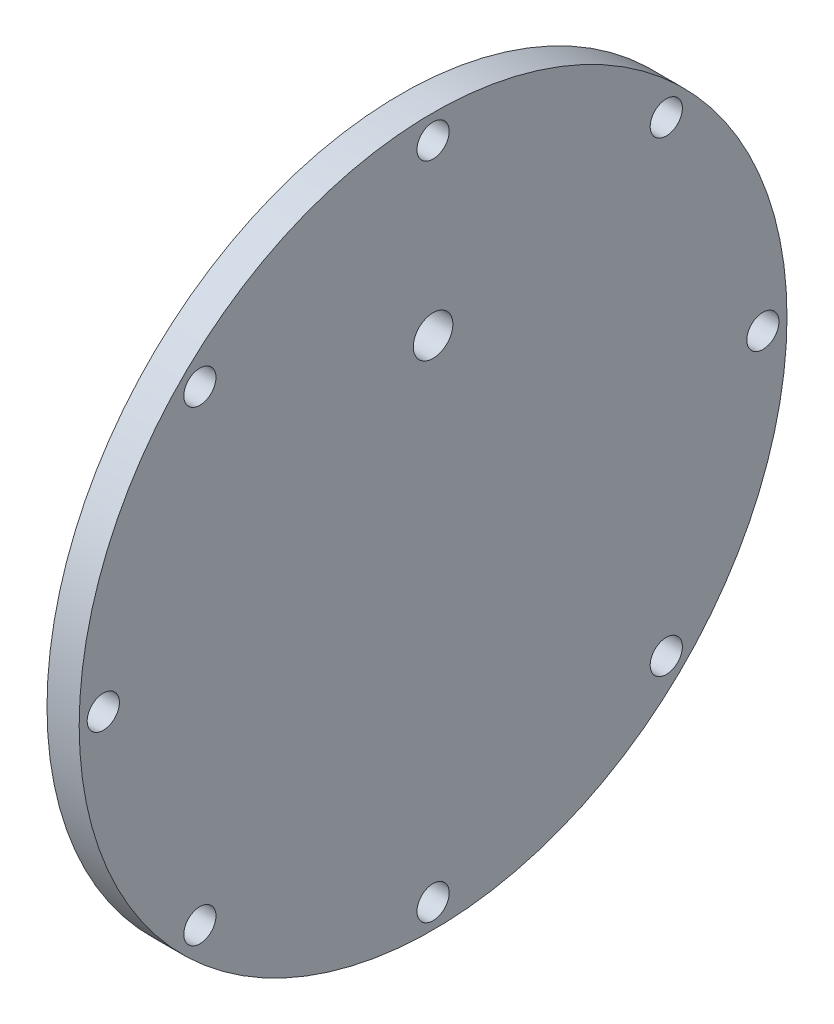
ISO-10303-21;
HEADER;
FILE_DESCRIPTION(('STEP AP214'),'2;1');
FILE_NAME('part.step','',(''),(''),'','','');
FILE_SCHEMA(('AUTOMOTIVE_DESIGN { 1 0 10303 214 1 1 1 1 }'));
ENDSEC;
DATA;
#1=APPLICATION_CONTEXT('core data for automotive mechanical design processes');
#2=APPLICATION_PROTOCOL_DEFINITION('international standard','automotive_design',2000,#1);
#3=PRODUCT_CONTEXT('',#1,'mechanical');
#4=PRODUCT('Part','Part','',(#3));
#5=PRODUCT_RELATED_PRODUCT_CATEGORY('part','',(#4));
#6=PRODUCT_DEFINITION_FORMATION('','',#4);
#7=PRODUCT_DEFINITION_CONTEXT('part definition',#1,'design');
#8=PRODUCT_DEFINITION('design','',#6,#7);
#9=PRODUCT_DEFINITION_SHAPE('','',#8);
#10=(LENGTH_UNIT() NAMED_UNIT(*) SI_UNIT(.MILLI.,.METRE.));
#11=(NAMED_UNIT(*) PLANE_ANGLE_UNIT() SI_UNIT($,.RADIAN.));
#12=(NAMED_UNIT(*) SI_UNIT($,.STERADIAN.) SOLID_ANGLE_UNIT());
#13=UNCERTAINTY_MEASURE_WITH_UNIT(LENGTH_MEASURE(1.E-05),#10,'distance_accuracy_value','');
#14=(GEOMETRIC_REPRESENTATION_CONTEXT(3) GLOBAL_UNCERTAINTY_ASSIGNED_CONTEXT((#13)) GLOBAL_UNIT_ASSIGNED_CONTEXT((#10,
#11,#12)) REPRESENTATION_CONTEXT('',''));
#15=CARTESIAN_POINT('',(0.,0.,0.));
#16=DIRECTION('',(0.,0.,1.));
#17=DIRECTION('',(1.,0.,0.));
#18=AXIS2_PLACEMENT_3D('',#15,#16,#17);
#19=CARTESIAN_POINT('',(6.35,0.,0.));
#20=DIRECTION('',(1.,0.,0.));
#21=DIRECTION('',(0.,0.,-1.));
#22=AXIS2_PLACEMENT_3D('',#19,#20,#21);
#23=PLANE('',#22);
#24=CARTESIAN_POINT('',(6.35,31.75,0.));
#25=DIRECTION('',(1.,0.,0.));
#26=DIRECTION('',(0.,0.,-1.));
#27=AXIS2_PLACEMENT_3D('',#24,#25,#26);
#28=CIRCLE('',#27,3.90271);
#29=CARTESIAN_POINT('',(6.35,31.75,-3.90271));
#30=VERTEX_POINT('',#29);
#31=EDGE_CURVE('E98',#30,#30,#28,.T.);
#32=ORIENTED_EDGE('',*,*,#31,.F.);
#33=EDGE_LOOP('',(#32));
#34=FACE_BOUND('',#33,.T.);
#35=CARTESIAN_POINT('',(6.35,6.81755374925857E-13,65.0875));
#36=DIRECTION('',(1.,0.,0.));
#37=DIRECTION('',(0.,0.,-1.));
#38=AXIS2_PLACEMENT_3D('',#35,#36,#37);
#39=CIRCLE('',#38,3.175);
#40=CARTESIAN_POINT('',(6.35,6.81755374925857E-13,61.9125));
#41=VERTEX_POINT('',#40);
#42=EDGE_CURVE('E85',#41,#41,#39,.T.);
#43=ORIENTED_EDGE('',*,*,#42,.F.);
#44=EDGE_LOOP('',(#43));
#45=FACE_BOUND('',#44,.T.);
#46=CARTESIAN_POINT('',(6.35,-65.0875,4.54503583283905E-13));
#47=DIRECTION('',(1.,0.,0.));
#48=DIRECTION('',(0.,0.,-1.));
#49=AXIS2_PLACEMENT_3D('',#46,#47,#48);
#50=CIRCLE('',#49,3.175);
#51=CARTESIAN_POINT('',(6.35,-65.0875,-3.17499999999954));
#52=VERTEX_POINT('',#51);
#53=EDGE_CURVE('E72',#52,#52,#50,.T.);
#54=ORIENTED_EDGE('',*,*,#53,.F.);
#55=EDGE_LOOP('',(#54));
#56=FACE_BOUND('',#55,.T.);
#57=CARTESIAN_POINT('',(6.35,-2.27251791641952E-13,-65.0875));
#58=DIRECTION('',(1.,0.,0.));
#59=DIRECTION('',(0.,0.,-1.));
#60=AXIS2_PLACEMENT_3D('',#57,#58,#59);
#61=CIRCLE('',#60,3.175);
#62=CARTESIAN_POINT('',(6.35,-2.27251791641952E-13,-68.2625));
#63=VERTEX_POINT('',#62);
#64=EDGE_CURVE('E56',#63,#63,#61,.T.);
#65=ORIENTED_EDGE('',*,*,#64,.F.);
#66=EDGE_LOOP('',(#65));
#67=FACE_BOUND('',#66,.T.);
#68=CARTESIAN_POINT('',(6.35,65.0875,0.));
#69=DIRECTION('',(1.,0.,0.));
#70=DIRECTION('',(0.,0.,-1.));
#71=AXIS2_PLACEMENT_3D('',#68,#69,#70);
#72=CIRCLE('',#71,3.175);
#73=CARTESIAN_POINT('',(6.35,65.0875,-3.175));
#74=VERTEX_POINT('',#73);
#75=EDGE_CURVE('E48',#74,#74,#72,.T.);
#76=ORIENTED_EDGE('',*,*,#75,.F.);
#77=EDGE_LOOP('',(#76));
#78=FACE_BOUND('',#77,.T.);
#79=CARTESIAN_POINT('',(6.35,0.,0.));
#80=DIRECTION('',(1.,0.,0.));
#81=DIRECTION('',(0.,0.,-1.));
#82=AXIS2_PLACEMENT_3D('',#79,#80,#81);
#83=CIRCLE('',#82,69.85);
#84=CARTESIAN_POINT('',(6.35,0.,-69.85));
#85=VERTEX_POINT('',#84);
#86=EDGE_CURVE('E10',#85,#85,#83,.T.);
#87=ORIENTED_EDGE('',*,*,#86,.T.);
#88=EDGE_LOOP('',(#87));
#89=FACE_BOUND('',#88,.T.);
#90=CARTESIAN_POINT('',(6.35,46.0238126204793,-46.0238126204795));
#91=DIRECTION('',(1.,0.,0.));
#92=DIRECTION('',(0.,0.,-1.));
#93=AXIS2_PLACEMENT_3D('',#90,#91,#92);
#94=CIRCLE('',#93,3.175);
#95=CARTESIAN_POINT('',(6.35,46.0238126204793,-49.1988126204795));
#96=VERTEX_POINT('',#95);
#97=EDGE_CURVE('E52',#96,#96,#94,.T.);
#98=ORIENTED_EDGE('',*,*,#97,.F.);
#99=EDGE_LOOP('',(#98));
#100=FACE_BOUND('',#99,.T.);
#101=CARTESIAN_POINT('',(6.35,-46.0238126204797,-46.0238126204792));
#102=DIRECTION('',(1.,0.,0.));
#103=DIRECTION('',(0.,0.,-1.));
#104=AXIS2_PLACEMENT_3D('',#101,#102,#103);
#105=CIRCLE('',#104,3.175);
#106=CARTESIAN_POINT('',(6.35,-46.0238126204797,-49.1988126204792));
#107=VERTEX_POINT('',#106);
#108=EDGE_CURVE('E62',#107,#107,#105,.T.);
#109=ORIENTED_EDGE('',*,*,#108,.F.);
#110=EDGE_LOOP('',(#109));
#111=FACE_BOUND('',#110,.T.);
#112=CARTESIAN_POINT('',(6.35,-46.023812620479,46.0238126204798));
#113=DIRECTION('',(1.,0.,0.));
#114=DIRECTION('',(0.,0.,-1.));
#115=AXIS2_PLACEMENT_3D('',#112,#113,#114);
#116=CIRCLE('',#115,3.175);
#117=CARTESIAN_POINT('',(6.35,-46.023812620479,42.8488126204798));
#118=VERTEX_POINT('',#117);
#119=EDGE_CURVE('E76',#118,#118,#116,.T.);
#120=ORIENTED_EDGE('',*,*,#119,.F.);
#121=EDGE_LOOP('',(#120));
#122=FACE_BOUND('',#121,.T.);
#123=CARTESIAN_POINT('',(6.35,46.02381262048,46.0238126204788));
#124=DIRECTION('',(1.,0.,0.));
#125=DIRECTION('',(0.,0.,-1.));
#126=AXIS2_PLACEMENT_3D('',#123,#124,#125);
#127=CIRCLE('',#126,3.175);
#128=CARTESIAN_POINT('',(6.35,46.02381262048,42.8488126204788));
#129=VERTEX_POINT('',#128);
#130=EDGE_CURVE('E90',#129,#129,#127,.T.);
#131=ORIENTED_EDGE('',*,*,#130,.F.);
#132=EDGE_LOOP('',(#131));
#133=FACE_BOUND('',#132,.T.);
#134=ADVANCED_FACE('F40',(#34,#45,#56,#67,#78,#89,#100,#111,#122,#133),#23,.T.);
#135=CARTESIAN_POINT('',(0.,0.,0.));
#136=DIRECTION('',(1.,0.,0.));
#137=DIRECTION('',(0.,0.,-1.));
#138=AXIS2_PLACEMENT_3D('',#135,#136,#137);
#139=PLANE('',#138);
#140=CARTESIAN_POINT('',(0.,31.75,0.));
#141=DIRECTION('',(1.,0.,0.));
#142=DIRECTION('',(0.,0.,-1.));
#143=AXIS2_PLACEMENT_3D('',#140,#141,#142);
#144=CIRCLE('',#143,3.90271);
#145=CARTESIAN_POINT('',(0.,31.75,-3.90271));
#146=VERTEX_POINT('',#145);
#147=EDGE_CURVE('E92',#146,#146,#144,.T.);
#148=ORIENTED_EDGE('',*,*,#147,.T.);
#149=EDGE_LOOP('',(#148));
#150=FACE_BOUND('',#149,.T.);
#151=CARTESIAN_POINT('',(0.,0.,0.));
#152=DIRECTION('',(1.,0.,0.));
#153=DIRECTION('',(0.,0.,-1.));
#154=AXIS2_PLACEMENT_3D('',#151,#152,#153);
#155=CIRCLE('',#154,69.85);
#156=CARTESIAN_POINT('',(0.,0.,-69.85));
#157=VERTEX_POINT('',#156);
#158=EDGE_CURVE('E41',#157,#157,#155,.T.);
#159=ORIENTED_EDGE('',*,*,#158,.F.);
#160=EDGE_LOOP('',(#159));
#161=FACE_BOUND('',#160,.T.);
#162=CARTESIAN_POINT('',(0.,65.0875,0.));
#163=DIRECTION('',(1.,0.,0.));
#164=DIRECTION('',(0.,0.,-1.));
#165=AXIS2_PLACEMENT_3D('',#162,#163,#164);
#166=CIRCLE('',#165,3.175);
#167=CARTESIAN_POINT('',(0.,65.0875,-3.175));
#168=VERTEX_POINT('',#167);
#169=EDGE_CURVE('E49',#168,#168,#166,.T.);
#170=ORIENTED_EDGE('',*,*,#169,.T.);
#171=EDGE_LOOP('',(#170));
#172=FACE_BOUND('',#171,.T.);
#173=CARTESIAN_POINT('',(0.,46.0238126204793,-46.0238126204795));
#174=DIRECTION('',(1.,0.,0.));
#175=DIRECTION('',(0.,0.,-1.));
#176=AXIS2_PLACEMENT_3D('',#173,#174,#175);
#177=CIRCLE('',#176,3.175);
#178=CARTESIAN_POINT('',(0.,46.0238126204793,-49.1988126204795));
#179=VERTEX_POINT('',#178);
#180=EDGE_CURVE('E57',#179,#179,#177,.T.);
#181=ORIENTED_EDGE('',*,*,#180,.T.);
#182=EDGE_LOOP('',(#181));
#183=FACE_BOUND('',#182,.T.);
#184=CARTESIAN_POINT('',(0.,-2.27251791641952E-13,-65.0875));
#185=DIRECTION('',(1.,0.,0.));
#186=DIRECTION('',(0.,0.,-1.));
#187=AXIS2_PLACEMENT_3D('',#184,#185,#186);
#188=CIRCLE('',#187,3.175);
#189=CARTESIAN_POINT('',(0.,-2.27251791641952E-13,-68.2625));
#190=VERTEX_POINT('',#189);
#191=EDGE_CURVE('E61',#190,#190,#188,.T.);
#192=ORIENTED_EDGE('',*,*,#191,.T.);
#193=EDGE_LOOP('',(#192));
#194=FACE_BOUND('',#193,.T.);
#195=CARTESIAN_POINT('',(0.,-46.0238126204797,-46.0238126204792));
#196=DIRECTION('',(1.,0.,0.));
#197=DIRECTION('',(0.,0.,-1.));
#198=AXIS2_PLACEMENT_3D('',#195,#196,#197);
#199=CIRCLE('',#198,3.175);
#200=CARTESIAN_POINT('',(0.,-46.0238126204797,-49.1988126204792));
#201=VERTEX_POINT('',#200);
#202=EDGE_CURVE('E70',#201,#201,#199,.T.);
#203=ORIENTED_EDGE('',*,*,#202,.T.);
#204=EDGE_LOOP('',(#203));
#205=FACE_BOUND('',#204,.T.);
#206=CARTESIAN_POINT('',(0.,-65.0875,4.54503583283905E-13));
#207=DIRECTION('',(1.,0.,0.));
#208=DIRECTION('',(0.,0.,-1.));
#209=AXIS2_PLACEMENT_3D('',#206,#207,#208);
#210=CIRCLE('',#209,3.175);
#211=CARTESIAN_POINT('',(0.,-65.0875,-3.17499999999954));
#212=VERTEX_POINT('',#211);
#213=EDGE_CURVE('E74',#212,#212,#210,.T.);
#214=ORIENTED_EDGE('',*,*,#213,.T.);
#215=EDGE_LOOP('',(#214));
#216=FACE_BOUND('',#215,.T.);
#217=CARTESIAN_POINT('',(0.,-46.023812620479,46.0238126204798));
#218=DIRECTION('',(1.,0.,0.));
#219=DIRECTION('',(0.,0.,-1.));
#220=AXIS2_PLACEMENT_3D('',#217,#218,#219);
#221=CIRCLE('',#220,3.175);
#222=CARTESIAN_POINT('',(0.,-46.023812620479,42.8488126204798));
#223=VERTEX_POINT('',#222);
#224=EDGE_CURVE('E77',#223,#223,#221,.T.);
#225=ORIENTED_EDGE('',*,*,#224,.T.);
#226=EDGE_LOOP('',(#225));
#227=FACE_BOUND('',#226,.T.);
#228=CARTESIAN_POINT('',(0.,6.81755374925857E-13,65.0875));
#229=DIRECTION('',(1.,0.,0.));
#230=DIRECTION('',(0.,0.,-1.));
#231=AXIS2_PLACEMENT_3D('',#228,#229,#230);
#232=CIRCLE('',#231,3.175);
#233=CARTESIAN_POINT('',(0.,6.81755374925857E-13,61.9125));
#234=VERTEX_POINT('',#233);
#235=EDGE_CURVE('E88',#234,#234,#232,.T.);
#236=ORIENTED_EDGE('',*,*,#235,.T.);
#237=EDGE_LOOP('',(#236));
#238=FACE_BOUND('',#237,.T.);
#239=CARTESIAN_POINT('',(0.,46.02381262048,46.0238126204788));
#240=DIRECTION('',(1.,0.,0.));
#241=DIRECTION('',(0.,0.,-1.));
#242=AXIS2_PLACEMENT_3D('',#239,#240,#241);
#243=CIRCLE('',#242,3.175);
#244=CARTESIAN_POINT('',(0.,46.02381262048,42.8488126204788));
#245=VERTEX_POINT('',#244);
#246=EDGE_CURVE('E95',#245,#245,#243,.T.);
#247=ORIENTED_EDGE('',*,*,#246,.T.);
#248=EDGE_LOOP('',(#247));
#249=FACE_BOUND('',#248,.T.);
#250=ADVANCED_FACE('F102',(#150,#161,#172,#183,#194,#205,#216,#227,#238,#249),#139,.F.);
#251=CARTESIAN_POINT('',(6.35,0.,0.));
#252=DIRECTION('',(-1.,0.,0.));
#253=DIRECTION('',(0.,0.,1.));
#254=AXIS2_PLACEMENT_3D('',#251,#252,#253);
#255=CYLINDRICAL_SURFACE('',#254,69.85);
#256=ORIENTED_EDGE('',*,*,#86,.F.);
#257=EDGE_LOOP('',(#256));
#258=FACE_BOUND('',#257,.T.);
#259=ORIENTED_EDGE('',*,*,#158,.T.);
#260=EDGE_LOOP('',(#259));
#261=FACE_BOUND('',#260,.T.);
#262=ADVANCED_FACE('F39',(#258,#261),#255,.T.);
#263=CARTESIAN_POINT('',(6.35,65.0875,0.));
#264=DIRECTION('',(-1.,0.,0.));
#265=DIRECTION('',(0.,0.,1.));
#266=AXIS2_PLACEMENT_3D('',#263,#264,#265);
#267=CYLINDRICAL_SURFACE('',#266,3.175);
#268=ORIENTED_EDGE('',*,*,#75,.T.);
#269=EDGE_LOOP('',(#268));
#270=FACE_BOUND('',#269,.T.);
#271=ORIENTED_EDGE('',*,*,#169,.F.);
#272=EDGE_LOOP('',(#271));
#273=FACE_BOUND('',#272,.T.);
#274=ADVANCED_FACE('F141',(#270,#273),#267,.F.);
#275=CARTESIAN_POINT('',(6.35,46.0238126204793,-46.0238126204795));
#276=DIRECTION('',(-1.,0.,0.));
#277=DIRECTION('',(0.,0.,1.));
#278=AXIS2_PLACEMENT_3D('',#275,#276,#277);
#279=CYLINDRICAL_SURFACE('',#278,3.175);
#280=ORIENTED_EDGE('',*,*,#97,.T.);
#281=EDGE_LOOP('',(#280));
#282=FACE_BOUND('',#281,.T.);
#283=ORIENTED_EDGE('',*,*,#180,.F.);
#284=EDGE_LOOP('',(#283));
#285=FACE_BOUND('',#284,.T.);
#286=ADVANCED_FACE('F146',(#282,#285),#279,.F.);
#287=CARTESIAN_POINT('',(6.35,-2.27251791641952E-13,-65.0875));
#288=DIRECTION('',(-1.,0.,0.));
#289=DIRECTION('',(0.,0.,1.));
#290=AXIS2_PLACEMENT_3D('',#287,#288,#289);
#291=CYLINDRICAL_SURFACE('',#290,3.175);
#292=ORIENTED_EDGE('',*,*,#64,.T.);
#293=EDGE_LOOP('',(#292));
#294=FACE_BOUND('',#293,.T.);
#295=ORIENTED_EDGE('',*,*,#191,.F.);
#296=EDGE_LOOP('',(#295));
#297=FACE_BOUND('',#296,.T.);
#298=ADVANCED_FACE('F155',(#294,#297),#291,.F.);
#299=CARTESIAN_POINT('',(6.35,-46.0238126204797,-46.0238126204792));
#300=DIRECTION('',(-1.,0.,0.));
#301=DIRECTION('',(0.,0.,1.));
#302=AXIS2_PLACEMENT_3D('',#299,#300,#301);
#303=CYLINDRICAL_SURFACE('',#302,3.175);
#304=ORIENTED_EDGE('',*,*,#108,.T.);
#305=EDGE_LOOP('',(#304));
#306=FACE_BOUND('',#305,.T.);
#307=ORIENTED_EDGE('',*,*,#202,.F.);
#308=EDGE_LOOP('',(#307));
#309=FACE_BOUND('',#308,.T.);
#310=ADVANCED_FACE('F156',(#306,#309),#303,.F.);
#311=CARTESIAN_POINT('',(6.35,-65.0875,4.54503583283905E-13));
#312=DIRECTION('',(-1.,0.,0.));
#313=DIRECTION('',(0.,0.,1.));
#314=AXIS2_PLACEMENT_3D('',#311,#312,#313);
#315=CYLINDRICAL_SURFACE('',#314,3.175);
#316=ORIENTED_EDGE('',*,*,#53,.T.);
#317=EDGE_LOOP('',(#316));
#318=FACE_BOUND('',#317,.T.);
#319=ORIENTED_EDGE('',*,*,#213,.F.);
#320=EDGE_LOOP('',(#319));
#321=FACE_BOUND('',#320,.T.);
#322=ADVANCED_FACE('F159',(#318,#321),#315,.F.);
#323=CARTESIAN_POINT('',(6.35,-46.023812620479,46.0238126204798));
#324=DIRECTION('',(-1.,0.,0.));
#325=DIRECTION('',(0.,0.,1.));
#326=AXIS2_PLACEMENT_3D('',#323,#324,#325);
#327=CYLINDRICAL_SURFACE('',#326,3.175);
#328=ORIENTED_EDGE('',*,*,#119,.T.);
#329=EDGE_LOOP('',(#328));
#330=FACE_BOUND('',#329,.T.);
#331=ORIENTED_EDGE('',*,*,#224,.F.);
#332=EDGE_LOOP('',(#331));
#333=FACE_BOUND('',#332,.T.);
#334=ADVANCED_FACE('F163',(#330,#333),#327,.F.);
#335=CARTESIAN_POINT('',(6.35,6.81755374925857E-13,65.0875));
#336=DIRECTION('',(-1.,0.,0.));
#337=DIRECTION('',(0.,0.,1.));
#338=AXIS2_PLACEMENT_3D('',#335,#336,#337);
#339=CYLINDRICAL_SURFACE('',#338,3.175);
#340=ORIENTED_EDGE('',*,*,#42,.T.);
#341=EDGE_LOOP('',(#340));
#342=FACE_BOUND('',#341,.T.);
#343=ORIENTED_EDGE('',*,*,#235,.F.);
#344=EDGE_LOOP('',(#343));
#345=FACE_BOUND('',#344,.T.);
#346=ADVANCED_FACE('F132',(#342,#345),#339,.F.);
#347=CARTESIAN_POINT('',(6.35,46.02381262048,46.0238126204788));
#348=DIRECTION('',(-1.,0.,0.));
#349=DIRECTION('',(0.,0.,1.));
#350=AXIS2_PLACEMENT_3D('',#347,#348,#349);
#351=CYLINDRICAL_SURFACE('',#350,3.175);
#352=ORIENTED_EDGE('',*,*,#130,.T.);
#353=EDGE_LOOP('',(#352));
#354=FACE_BOUND('',#353,.T.);
#355=ORIENTED_EDGE('',*,*,#246,.F.);
#356=EDGE_LOOP('',(#355));
#357=FACE_BOUND('',#356,.T.);
#358=ADVANCED_FACE('F109',(#354,#357),#351,.F.);
#359=CARTESIAN_POINT('',(0.,31.75,0.));
#360=DIRECTION('',(1.,0.,0.));
#361=DIRECTION('',(0.,0.,-1.));
#362=AXIS2_PLACEMENT_3D('',#359,#360,#361);
#363=CYLINDRICAL_SURFACE('',#362,3.90271);
#364=ORIENTED_EDGE('',*,*,#147,.F.);
#365=EDGE_LOOP('',(#364));
#366=FACE_BOUND('',#365,.T.);
#367=ORIENTED_EDGE('',*,*,#31,.T.);
#368=EDGE_LOOP('',(#367));
#369=FACE_BOUND('',#368,.T.);
#370=ADVANCED_FACE('F110',(#366,#369),#363,.F.);
#371=CLOSED_SHELL('',(#134,#250,#262,#274,#286,#298,#310,#322,#334,#346,#358,#370));
#372=MANIFOLD_SOLID_BREP('B2',#371);
#373=ADVANCED_BREP_SHAPE_REPRESENTATION('',(#18,#372),#14);
#374=SHAPE_DEFINITION_REPRESENTATION(#9,#373);
ENDSEC;
END-ISO-10303-21;
